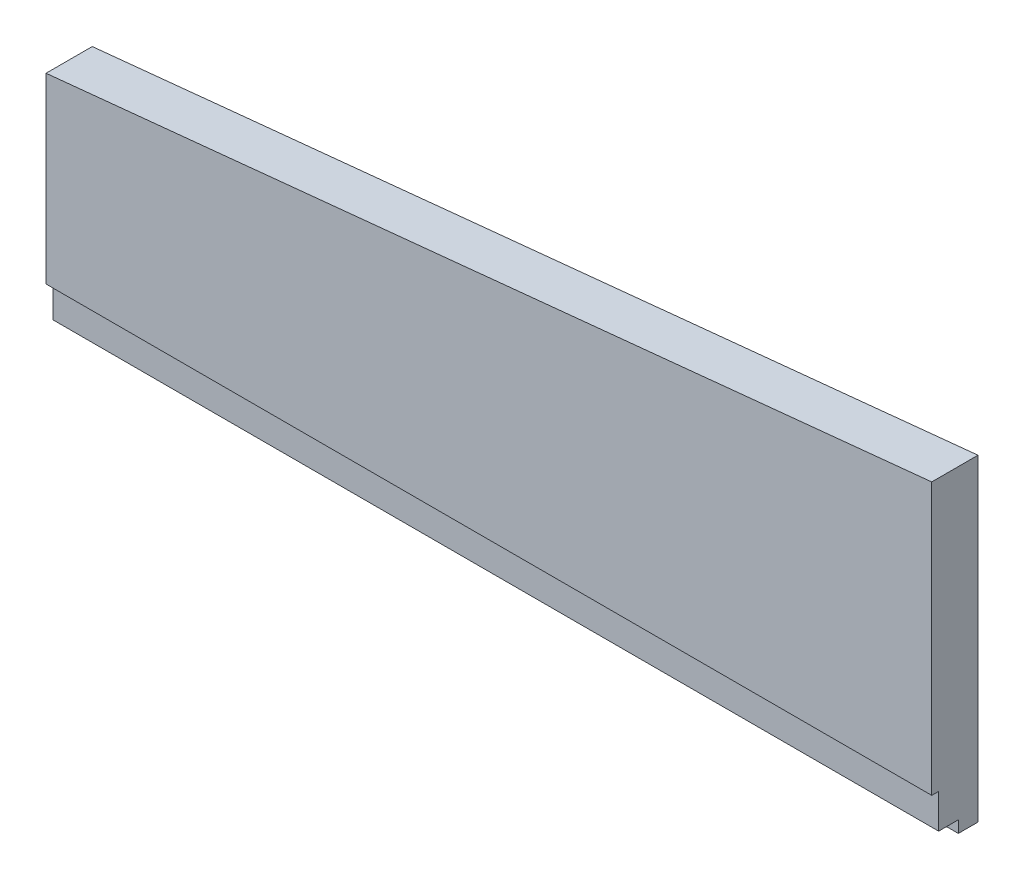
ISO-10303-21;
HEADER;
FILE_DESCRIPTION(('STEP AP214'),'2;1');
FILE_NAME('part.step','',(''),(''),'','','');
FILE_SCHEMA(('AUTOMOTIVE_DESIGN { 1 0 10303 214 1 1 1 1 }'));
ENDSEC;
DATA;
#1=APPLICATION_CONTEXT('core data for automotive mechanical design processes');
#2=APPLICATION_PROTOCOL_DEFINITION('international standard','automotive_design',2000,#1);
#3=PRODUCT_CONTEXT('',#1,'mechanical');
#4=PRODUCT('Part','Part','',(#3));
#5=PRODUCT_RELATED_PRODUCT_CATEGORY('part','',(#4));
#6=PRODUCT_DEFINITION_FORMATION('','',#4);
#7=PRODUCT_DEFINITION_CONTEXT('part definition',#1,'design');
#8=PRODUCT_DEFINITION('design','',#6,#7);
#9=PRODUCT_DEFINITION_SHAPE('','',#8);
#10=(LENGTH_UNIT() NAMED_UNIT(*) SI_UNIT(.MILLI.,.METRE.));
#11=(NAMED_UNIT(*) PLANE_ANGLE_UNIT() SI_UNIT($,.RADIAN.));
#12=(NAMED_UNIT(*) SI_UNIT($,.STERADIAN.) SOLID_ANGLE_UNIT());
#13=UNCERTAINTY_MEASURE_WITH_UNIT(LENGTH_MEASURE(1.E-05),#10,'distance_accuracy_value','');
#14=(GEOMETRIC_REPRESENTATION_CONTEXT(3) GLOBAL_UNCERTAINTY_ASSIGNED_CONTEXT((#13)) GLOBAL_UNIT_ASSIGNED_CONTEXT((#10,
#11,#12)) REPRESENTATION_CONTEXT('',''));
#15=CARTESIAN_POINT('',(0.,0.,0.));
#16=DIRECTION('',(0.,0.,1.));
#17=DIRECTION('',(1.,0.,0.));
#18=AXIS2_PLACEMENT_3D('',#15,#16,#17);
#19=CARTESIAN_POINT('',(-900.,-1821.46075731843,40.));
#20=DIRECTION('',(0.,-1.,0.));
#21=DIRECTION('',(0.,0.,-1.));
#22=AXIS2_PLACEMENT_3D('',#19,#20,#21);
#23=PLANE('',#22);
#24=DIRECTION('',(0.,0.,-1.));
#25=VECTOR('',#24,1.);
#26=CARTESIAN_POINT('',(-900.,-1821.46075731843,40.));
#27=LINE('',#26,#25);
#28=CARTESIAN_POINT('',(-900.,-1821.46075731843,40.));
#29=VERTEX_POINT('',#28);
#30=CARTESIAN_POINT('',(-900.,-1821.46075731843,20.));
#31=VERTEX_POINT('',#30);
#32=EDGE_CURVE('E110',#29,#31,#27,.T.);
#33=ORIENTED_EDGE('',*,*,#32,.T.);
#34=DIRECTION('',(1.,0.,0.));
#35=VECTOR('',#34,1.);
#36=CARTESIAN_POINT('',(0.,-1821.46075731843,20.));
#37=LINE('',#36,#35);
#38=CARTESIAN_POINT('',(0.,-1821.46075731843,20.));
#39=VERTEX_POINT('',#38);
#40=EDGE_CURVE('E122',#31,#39,#37,.T.);
#41=ORIENTED_EDGE('',*,*,#40,.T.);
#42=DIRECTION('',(0.,0.,-1.));
#43=VECTOR('',#42,1.);
#44=CARTESIAN_POINT('',(0.,-1821.46075731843,40.));
#45=LINE('',#44,#43);
#46=CARTESIAN_POINT('',(0.,-1821.46075731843,40.));
#47=VERTEX_POINT('',#46);
#48=EDGE_CURVE('E143',#47,#39,#45,.T.);
#49=ORIENTED_EDGE('',*,*,#48,.F.);
#50=DIRECTION('',(-1.,0.,0.));
#51=VECTOR('',#50,1.);
#52=CARTESIAN_POINT('',(-900.,-1821.46075731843,40.));
#53=LINE('',#52,#51);
#54=EDGE_CURVE('E146',#47,#29,#53,.T.);
#55=ORIENTED_EDGE('',*,*,#54,.T.);
#56=EDGE_LOOP('',(#33,#41,#49,#55));
#57=FACE_BOUND('',#56,.T.);
#58=ADVANCED_FACE('F31',(#57),#23,.T.);
#59=CARTESIAN_POINT('',(-900.,-1786.46075731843,47.));
#60=DIRECTION('',(0.,1.,0.));
#61=DIRECTION('',(0.,0.,1.));
#62=AXIS2_PLACEMENT_3D('',#59,#60,#61);
#63=PLANE('',#62);
#64=DIRECTION('',(0.,0.,-1.));
#65=VECTOR('',#64,1.);
#66=CARTESIAN_POINT('',(-900.,-1786.46075731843,47.));
#67=LINE('',#66,#65);
#68=CARTESIAN_POINT('',(-900.,-1786.46075731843,47.));
#69=VERTEX_POINT('',#68);
#70=CARTESIAN_POINT('',(-900.,-1786.46075731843,40.));
#71=VERTEX_POINT('',#70);
#72=EDGE_CURVE('E167',#69,#71,#67,.T.);
#73=ORIENTED_EDGE('',*,*,#72,.T.);
#74=DIRECTION('',(1.,0.,0.));
#75=VECTOR('',#74,1.);
#76=CARTESIAN_POINT('',(2.22044604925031E-13,-1786.46075731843,40.));
#77=LINE('',#76,#75);
#78=CARTESIAN_POINT('',(2.22044604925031E-13,-1786.46075731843,40.));
#79=VERTEX_POINT('',#78);
#80=EDGE_CURVE('E176',#71,#79,#77,.T.);
#81=ORIENTED_EDGE('',*,*,#80,.T.);
#82=DIRECTION('',(0.,0.,-1.));
#83=VECTOR('',#82,1.);
#84=CARTESIAN_POINT('',(2.22044604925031E-13,-1786.46075731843,47.));
#85=LINE('',#84,#83);
#86=CARTESIAN_POINT('',(2.22044604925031E-13,-1786.46075731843,47.));
#87=VERTEX_POINT('',#86);
#88=EDGE_CURVE('E11',#87,#79,#85,.T.);
#89=ORIENTED_EDGE('',*,*,#88,.F.);
#90=DIRECTION('',(1.,0.,0.));
#91=VECTOR('',#90,1.);
#92=CARTESIAN_POINT('',(-900.,-1786.46075731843,47.));
#93=LINE('',#92,#91);
#94=EDGE_CURVE('E158',#69,#87,#93,.T.);
#95=ORIENTED_EDGE('',*,*,#94,.F.);
#96=EDGE_LOOP('',(#73,#81,#89,#95));
#97=FACE_BOUND('',#96,.T.);
#98=ADVANCED_FACE('F33',(#97),#63,.F.);
#99=CARTESIAN_POINT('',(1.84989439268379E-13,-1510.60329460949,47.));
#100=DIRECTION('',(-1.,0.,0.));
#101=DIRECTION('',(0.,-1.,0.));
#102=AXIS2_PLACEMENT_3D('',#99,#100,#101);
#103=PLANE('',#102);
#104=DIRECTION('',(0.,1.,0.));
#105=VECTOR('',#104,1.);
#106=CARTESIAN_POINT('',(1.84989439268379E-13,-1510.60329460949,0.));
#107=LINE('',#106,#105);
#108=CARTESIAN_POINT('',(0.,-1833.46075731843,0.));
#109=VERTEX_POINT('',#108);
#110=CARTESIAN_POINT('',(1.84989439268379E-13,-1510.60329460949,0.));
#111=VERTEX_POINT('',#110);
#112=EDGE_CURVE('E100',#109,#111,#107,.T.);
#113=ORIENTED_EDGE('',*,*,#112,.T.);
#114=DIRECTION('',(0.,0.,-1.));
#115=VECTOR('',#114,1.);
#116=CARTESIAN_POINT('',(1.84989439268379E-13,-1510.60329460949,47.));
#117=LINE('',#116,#115);
#118=CARTESIAN_POINT('',(1.84989439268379E-13,-1510.60329460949,47.));
#119=VERTEX_POINT('',#118);
#120=EDGE_CURVE('E40',#119,#111,#117,.T.);
#121=ORIENTED_EDGE('',*,*,#120,.F.);
#122=DIRECTION('',(0.,1.,0.));
#123=VECTOR('',#122,1.);
#124=CARTESIAN_POINT('',(1.84989439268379E-13,-1510.60329460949,47.));
#125=LINE('',#124,#123);
#126=EDGE_CURVE('E161',#87,#119,#125,.T.);
#127=ORIENTED_EDGE('',*,*,#126,.F.);
#128=ORIENTED_EDGE('',*,*,#88,.T.);
#129=DIRECTION('',(0.,-1.,0.));
#130=VECTOR('',#129,1.);
#131=CARTESIAN_POINT('',(2.22044604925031E-13,-1786.46075731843,40.));
#132=LINE('',#131,#130);
#133=EDGE_CURVE('E56',#79,#47,#132,.T.);
#134=ORIENTED_EDGE('',*,*,#133,.T.);
#135=ORIENTED_EDGE('',*,*,#48,.T.);
#136=DIRECTION('',(0.,-1.,0.));
#137=VECTOR('',#136,1.);
#138=CARTESIAN_POINT('',(0.,-1821.46075731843,20.));
#139=LINE('',#138,#137);
#140=CARTESIAN_POINT('',(0.,-1833.46075731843,20.));
#141=VERTEX_POINT('',#140);
#142=EDGE_CURVE('E48',#39,#141,#139,.T.);
#143=ORIENTED_EDGE('',*,*,#142,.T.);
#144=DIRECTION('',(0.,0.,-1.));
#145=VECTOR('',#144,1.);
#146=CARTESIAN_POINT('',(0.,-1833.46075731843,20.));
#147=LINE('',#146,#145);
#148=EDGE_CURVE('E112',#141,#109,#147,.T.);
#149=ORIENTED_EDGE('',*,*,#148,.T.);
#150=EDGE_LOOP('',(#113,#121,#127,#128,#134,#135,#143,#149));
#151=FACE_BOUND('',#150,.T.);
#152=ADVANCED_FACE('F113',(#151),#103,.F.);
#153=CARTESIAN_POINT('',(1.84989439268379E-13,-1510.60329460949,47.));
#154=DIRECTION('',(0.0999382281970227,-0.994993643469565,0.));
#155=DIRECTION('',(0.994993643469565,0.0999382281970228,0.));
#156=AXIS2_PLACEMENT_3D('',#153,#154,#155);
#157=PLANE('',#156);
#158=DIRECTION('',(-0.994993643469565,-0.0999382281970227,0.));
#159=VECTOR('',#158,1.);
#160=CARTESIAN_POINT('',(1.84989439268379E-13,-1510.60329460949,0.));
#161=LINE('',#160,#159);
#162=CARTESIAN_POINT('',(-900.,-1601.00025942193,0.));
#163=VERTEX_POINT('',#162);
#164=EDGE_CURVE('E106',#111,#163,#161,.T.);
#165=ORIENTED_EDGE('',*,*,#164,.T.);
#166=DIRECTION('',(0.,0.,-1.));
#167=VECTOR('',#166,1.);
#168=CARTESIAN_POINT('',(-900.,-1601.00025942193,47.));
#169=LINE('',#168,#167);
#170=CARTESIAN_POINT('',(-900.,-1601.00025942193,47.));
#171=VERTEX_POINT('',#170);
#172=EDGE_CURVE('E170',#171,#163,#169,.T.);
#173=ORIENTED_EDGE('',*,*,#172,.F.);
#174=DIRECTION('',(-0.994993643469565,-0.0999382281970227,0.));
#175=VECTOR('',#174,1.);
#176=CARTESIAN_POINT('',(1.84989439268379E-13,-1510.60329460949,47.));
#177=LINE('',#176,#175);
#178=EDGE_CURVE('E163',#119,#171,#177,.T.);
#179=ORIENTED_EDGE('',*,*,#178,.F.);
#180=ORIENTED_EDGE('',*,*,#120,.T.);
#181=EDGE_LOOP('',(#165,#173,#179,#180));
#182=FACE_BOUND('',#181,.T.);
#183=ADVANCED_FACE('F196',(#182),#157,.F.);
#184=CARTESIAN_POINT('',(-900.,-1601.00025942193,47.));
#185=DIRECTION('',(1.,0.,0.));
#186=DIRECTION('',(0.,1.,0.));
#187=AXIS2_PLACEMENT_3D('',#184,#185,#186);
#188=PLANE('',#187);
#189=DIRECTION('',(0.,-1.,0.));
#190=VECTOR('',#189,1.);
#191=CARTESIAN_POINT('',(-900.,-1601.00025942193,0.));
#192=LINE('',#191,#190);
#193=CARTESIAN_POINT('',(-900.,-1833.46075731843,0.));
#194=VERTEX_POINT('',#193);
#195=EDGE_CURVE('E156',#163,#194,#192,.T.);
#196=ORIENTED_EDGE('',*,*,#195,.T.);
#197=DIRECTION('',(0.,0.,-1.));
#198=VECTOR('',#197,1.);
#199=CARTESIAN_POINT('',(-900.,-1833.46075731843,20.));
#200=LINE('',#199,#198);
#201=CARTESIAN_POINT('',(-900.,-1833.46075731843,20.));
#202=VERTEX_POINT('',#201);
#203=EDGE_CURVE('E117',#202,#194,#200,.T.);
#204=ORIENTED_EDGE('',*,*,#203,.F.);
#205=DIRECTION('',(0.,1.,0.));
#206=VECTOR('',#205,1.);
#207=CARTESIAN_POINT('',(-900.,-1821.46075731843,20.));
#208=LINE('',#207,#206);
#209=EDGE_CURVE('E118',#202,#31,#208,.T.);
#210=ORIENTED_EDGE('',*,*,#209,.T.);
#211=ORIENTED_EDGE('',*,*,#32,.F.);
#212=DIRECTION('',(0.,1.,0.));
#213=VECTOR('',#212,1.);
#214=CARTESIAN_POINT('',(-900.,-1786.46075731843,40.));
#215=LINE('',#214,#213);
#216=EDGE_CURVE('E144',#29,#71,#215,.T.);
#217=ORIENTED_EDGE('',*,*,#216,.T.);
#218=ORIENTED_EDGE('',*,*,#72,.F.);
#219=DIRECTION('',(0.,-1.,0.));
#220=VECTOR('',#219,1.);
#221=CARTESIAN_POINT('',(-900.,-1601.00025942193,47.));
#222=LINE('',#221,#220);
#223=EDGE_CURVE('E165',#171,#69,#222,.T.);
#224=ORIENTED_EDGE('',*,*,#223,.F.);
#225=ORIENTED_EDGE('',*,*,#172,.T.);
#226=EDGE_LOOP('',(#196,#204,#210,#211,#217,#218,#224,#225));
#227=FACE_BOUND('',#226,.T.);
#228=ADVANCED_FACE('F184',(#227),#188,.F.);
#229=CARTESIAN_POINT('',(2.22044604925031E-13,-1786.46075731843,47.));
#230=DIRECTION('',(0.,0.,-1.));
#231=DIRECTION('',(-1.,0.,0.));
#232=AXIS2_PLACEMENT_3D('',#229,#230,#231);
#233=PLANE('',#232);
#234=ORIENTED_EDGE('',*,*,#94,.T.);
#235=ORIENTED_EDGE('',*,*,#126,.T.);
#236=ORIENTED_EDGE('',*,*,#178,.T.);
#237=ORIENTED_EDGE('',*,*,#223,.T.);
#238=EDGE_LOOP('',(#234,#235,#236,#237));
#239=FACE_BOUND('',#238,.T.);
#240=ADVANCED_FACE('F190',(#239),#233,.F.);
#241=CARTESIAN_POINT('',(2.22044604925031E-13,-1786.46075731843,0.));
#242=DIRECTION('',(0.,0.,-1.));
#243=DIRECTION('',(-1.,0.,0.));
#244=AXIS2_PLACEMENT_3D('',#241,#242,#243);
#245=PLANE('',#244);
#246=ORIENTED_EDGE('',*,*,#112,.F.);
#247=DIRECTION('',(-1.,0.,0.));
#248=VECTOR('',#247,1.);
#249=CARTESIAN_POINT('',(-900.,-1833.46075731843,0.));
#250=LINE('',#249,#248);
#251=EDGE_CURVE('E105',#109,#194,#250,.T.);
#252=ORIENTED_EDGE('',*,*,#251,.T.);
#253=ORIENTED_EDGE('',*,*,#195,.F.);
#254=ORIENTED_EDGE('',*,*,#164,.F.);
#255=EDGE_LOOP('',(#246,#252,#253,#254));
#256=FACE_BOUND('',#255,.T.);
#257=ADVANCED_FACE('F102',(#256),#245,.T.);
#258=CARTESIAN_POINT('',(-900.,-1786.46075731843,40.));
#259=DIRECTION('',(0.,0.,1.));
#260=DIRECTION('',(1.,0.,0.));
#261=AXIS2_PLACEMENT_3D('',#258,#259,#260);
#262=PLANE('',#261);
#263=ORIENTED_EDGE('',*,*,#80,.F.);
#264=ORIENTED_EDGE('',*,*,#216,.F.);
#265=ORIENTED_EDGE('',*,*,#54,.F.);
#266=ORIENTED_EDGE('',*,*,#133,.F.);
#267=EDGE_LOOP('',(#263,#264,#265,#266));
#268=FACE_BOUND('',#267,.T.);
#269=ADVANCED_FACE('F182',(#268),#262,.T.);
#270=CARTESIAN_POINT('',(-900.,-1833.46075731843,20.));
#271=DIRECTION('',(0.,-1.,0.));
#272=DIRECTION('',(0.,0.,-1.));
#273=AXIS2_PLACEMENT_3D('',#270,#271,#272);
#274=PLANE('',#273);
#275=ORIENTED_EDGE('',*,*,#251,.F.);
#276=ORIENTED_EDGE('',*,*,#148,.F.);
#277=DIRECTION('',(-1.,0.,0.));
#278=VECTOR('',#277,1.);
#279=CARTESIAN_POINT('',(-900.,-1833.46075731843,20.));
#280=LINE('',#279,#278);
#281=EDGE_CURVE('E128',#141,#202,#280,.T.);
#282=ORIENTED_EDGE('',*,*,#281,.T.);
#283=ORIENTED_EDGE('',*,*,#203,.T.);
#284=EDGE_LOOP('',(#275,#276,#282,#283));
#285=FACE_BOUND('',#284,.T.);
#286=ADVANCED_FACE('F121',(#285),#274,.T.);
#287=CARTESIAN_POINT('',(-900.,-1821.46075731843,20.));
#288=DIRECTION('',(0.,0.,1.));
#289=DIRECTION('',(1.,0.,0.));
#290=AXIS2_PLACEMENT_3D('',#287,#288,#289);
#291=PLANE('',#290);
#292=ORIENTED_EDGE('',*,*,#40,.F.);
#293=ORIENTED_EDGE('',*,*,#209,.F.);
#294=ORIENTED_EDGE('',*,*,#281,.F.);
#295=ORIENTED_EDGE('',*,*,#142,.F.);
#296=EDGE_LOOP('',(#292,#293,#294,#295));
#297=FACE_BOUND('',#296,.T.);
#298=ADVANCED_FACE('F140',(#297),#291,.T.);
#299=CLOSED_SHELL('',(#58,#98,#152,#183,#228,#240,#257,#269,#286,#298));
#300=MANIFOLD_SOLID_BREP('B2',#299);
#301=ADVANCED_BREP_SHAPE_REPRESENTATION('',(#18,#300),#14);
#302=SHAPE_DEFINITION_REPRESENTATION(#9,#301);
ENDSEC;
END-ISO-10303-21;
